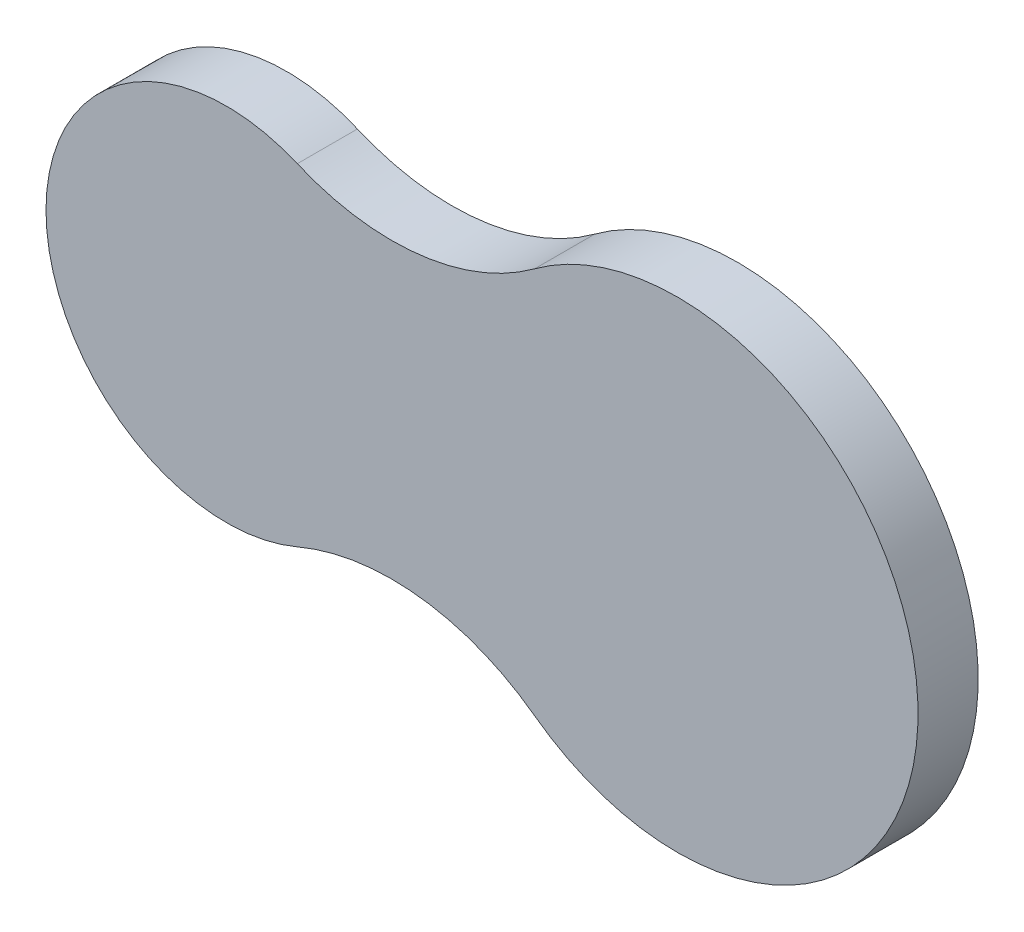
from build123d import *

# Parameters (mm, degrees)
EXTRUDE1_DEPTH = 10


with BuildPart() as part:
    # Sketch1 → Extrude1 (new body)
    with BuildSketch(Plane.XY):
        with BuildLine():
            ThreePointArc((11.785714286, 27.587985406), (-30, 0), (11.785714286, -27.587985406))
            ThreePointArc((11.785714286, -27.587985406), (32.129100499, -24.64072599), (51.25, -32.185982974))
            ThreePointArc((51.25, -32.185982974), (115, 0), (51.25, 32.185982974))
            ThreePointArc((51.25, 32.185982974), (32.129100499, 24.64072599), (11.785714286, 27.587985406))
        make_face()
    extrude(amount=EXTRUDE1_DEPTH)


solid = part.part
